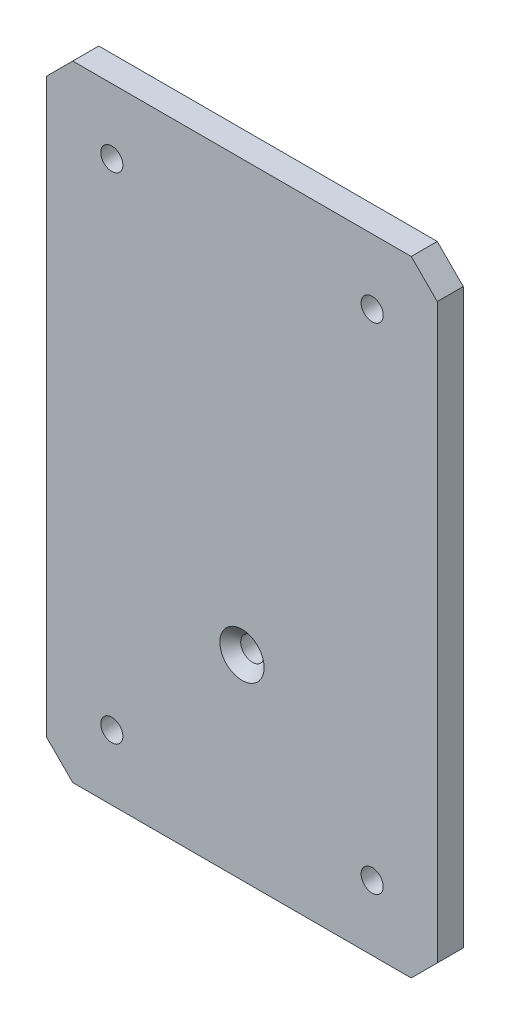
from build123d import *

# Parameters (mm, degrees)
ESQUISSE1_R          = 4.25
ESQUISSE1_R_2        = 4.5
BASE_EXTRUSION_DEPTH = 10
CHANFREIN1_SIZE      = 4


with BuildPart() as part:
    # Esquisse1 → Base-Extrusion (new body)
    with BuildSketch(Plane.XY):
        Polygon((150, 230), (140, 240), (10, 240), (0, 230), (0, 10), (10, 0), (140, 0), (150, 10), align=None)
        with Locations((25, 215)):
            Circle(ESQUISSE1_R, mode=Mode.SUBTRACT)
        with Locations((125, 215)):
            Circle(ESQUISSE1_R, mode=Mode.SUBTRACT)
        with Locations((25, 25)):
            Circle(ESQUISSE1_R, mode=Mode.SUBTRACT)
        with Locations((125, 25)):
            Circle(ESQUISSE1_R, mode=Mode.SUBTRACT)
        with Locations(Location((75, 75, 0), (0, 0, 180))):
            Circle(ESQUISSE1_R_2, mode=Mode.SUBTRACT)
    extrude(amount=BASE_EXTRUSION_DEPTH)

    # Chanfrein1
    chanfrein1_edges = [part.edges().sort_by_distance(p)[0] for p in [
        (79.5, 75, 10),
    ]]
    chamfer(chanfrein1_edges, length=CHANFREIN1_SIZE)


solid = part.part
